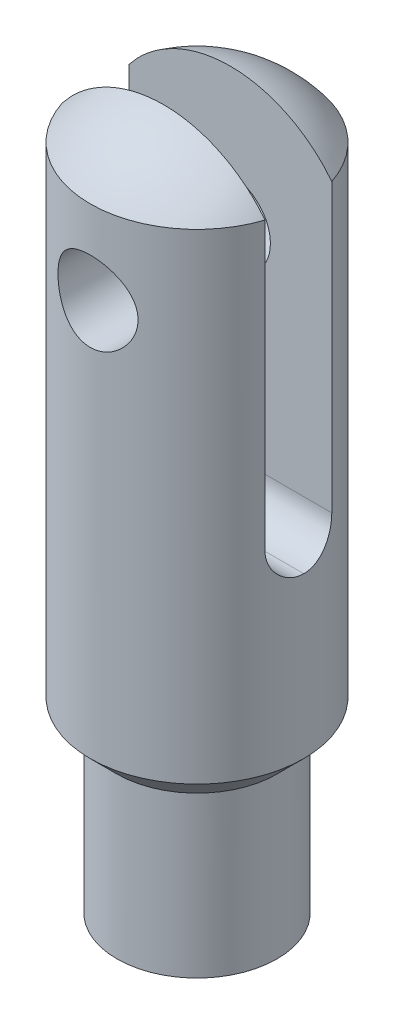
ISO-10303-21;
HEADER;
FILE_DESCRIPTION(('STEP AP214'),'2;1');
FILE_NAME('part.step','',(''),(''),'','','');
FILE_SCHEMA(('AUTOMOTIVE_DESIGN { 1 0 10303 214 1 1 1 1 }'));
ENDSEC;
DATA;
#1=APPLICATION_CONTEXT('core data for automotive mechanical design processes');
#2=APPLICATION_PROTOCOL_DEFINITION('international standard','automotive_design',2000,#1);
#3=PRODUCT_CONTEXT('',#1,'mechanical');
#4=PRODUCT('Part','Part','',(#3));
#5=PRODUCT_RELATED_PRODUCT_CATEGORY('part','',(#4));
#6=PRODUCT_DEFINITION_FORMATION('','',#4);
#7=PRODUCT_DEFINITION_CONTEXT('part definition',#1,'design');
#8=PRODUCT_DEFINITION('design','',#6,#7);
#9=PRODUCT_DEFINITION_SHAPE('','',#8);
#10=(LENGTH_UNIT() NAMED_UNIT(*) SI_UNIT(.MILLI.,.METRE.));
#11=(NAMED_UNIT(*) PLANE_ANGLE_UNIT() SI_UNIT($,.RADIAN.));
#12=(NAMED_UNIT(*) SI_UNIT($,.STERADIAN.) SOLID_ANGLE_UNIT());
#13=UNCERTAINTY_MEASURE_WITH_UNIT(LENGTH_MEASURE(1.E-05),#10,'distance_accuracy_value','');
#14=(GEOMETRIC_REPRESENTATION_CONTEXT(3) GLOBAL_UNCERTAINTY_ASSIGNED_CONTEXT((#13)) GLOBAL_UNIT_ASSIGNED_CONTEXT((#10,
#11,#12)) REPRESENTATION_CONTEXT('',''));
#15=CARTESIAN_POINT('',(0.,0.,0.));
#16=DIRECTION('',(0.,0.,1.));
#17=DIRECTION('',(1.,0.,0.));
#18=AXIS2_PLACEMENT_3D('',#15,#16,#17);
#19=CARTESIAN_POINT('',(4.,0.,0.));
#20=DIRECTION('',(0.,-1.,0.));
#21=DIRECTION('',(0.,0.,-1.));
#22=AXIS2_PLACEMENT_3D('',#19,#20,#21);
#23=CYLINDRICAL_SURFACE('',#22,4.);
#24=CARTESIAN_POINT('',(4.,0.,0.));
#25=DIRECTION('',(0.,-1.,0.));
#26=DIRECTION('',(0.,0.,-1.));
#27=AXIS2_PLACEMENT_3D('',#24,#25,#26);
#28=CIRCLE('',#27,4.);
#29=CARTESIAN_POINT('',(4.,0.,-4.));
#30=VERTEX_POINT('',#29);
#31=EDGE_CURVE('E121',#30,#30,#28,.T.);
#32=ORIENTED_EDGE('',*,*,#31,.F.);
#33=EDGE_LOOP('',(#32));
#34=FACE_BOUND('',#33,.T.);
#35=CARTESIAN_POINT('',(0.200328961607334,7.25,1.25));
#36=CARTESIAN_POINT('',(0.200332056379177,7.2157561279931,1.2500007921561));
#37=CARTESIAN_POINT('',(0.199865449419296,7.18152958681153,1.24859192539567));
#38=CARTESIAN_POINT('',(0.19802439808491,7.1133393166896,1.24297810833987));
#39=CARTESIAN_POINT('',(0.196650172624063,7.0793755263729,1.23877383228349));
#40=CARTESIAN_POINT('',(0.191226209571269,6.97844047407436,1.22204230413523));
#41=CARTESIAN_POINT('',(0.185874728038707,6.91217369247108,1.205395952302));
#42=CARTESIAN_POINT('',(0.172342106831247,6.78355649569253,1.16170143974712));
#43=CARTESIAN_POINT('',(0.164162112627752,6.72120450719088,1.13465748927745));
#44=CARTESIAN_POINT('',(0.145899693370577,6.60187177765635,1.07098313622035));
#45=CARTESIAN_POINT('',(0.135816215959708,6.54489403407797,1.03434742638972));
#46=CARTESIAN_POINT('',(0.11449905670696,6.43602191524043,0.951197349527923));
#47=CARTESIAN_POINT('',(0.103239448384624,6.38433923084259,0.904412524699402));
#48=CARTESIAN_POINT('',(0.0810581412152,6.28940663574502,0.802864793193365));
#49=CARTESIAN_POINT('',(0.0701365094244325,6.24615838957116,0.748100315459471));
#50=CARTESIAN_POINT('',(0.0495611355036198,6.16837616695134,0.630607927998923));
#51=CARTESIAN_POINT('',(0.0399422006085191,6.13406470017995,0.567726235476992));
#52=CARTESIAN_POINT('',(0.023369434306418,6.07660741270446,0.436752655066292));
#53=CARTESIAN_POINT('',(0.0164132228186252,6.0534516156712,0.368665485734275));
#54=CARTESIAN_POINT('',(0.00753372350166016,6.02426752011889,0.250216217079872));
#55=CARTESIAN_POINT('',(0.00472710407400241,6.01518682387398,0.200651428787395));
#56=CARTESIAN_POINT('',(0.000952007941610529,6.00304637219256,0.100734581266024));
#57=CARTESIAN_POINT('',(-1.69089153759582E-05,5.99998517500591,0.0503827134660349));
#58=CARTESIAN_POINT('',(0.,6.,0.));
#59=B_SPLINE_CURVE_WITH_KNOTS('',3,(#35,#36,#37,#38,#39,#40,#41,#42,#43,#44,#45,#46,#47,#48,#49,
#50,#51,#52,#53,#54,#55,#56,#57,#58),.UNSPECIFIED.,.F.,.F.,(4,2,2,2,2,2,2,2,2,2,2,4),(0.,
0.102665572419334,0.20530639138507,0.409842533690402,0.614295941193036,0.818862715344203,
1.02975563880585,1.24069013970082,1.45646042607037,1.67203739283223,1.82306277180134,
1.97405197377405),.UNSPECIFIED.);
#60=CARTESIAN_POINT('',(0.200328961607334,7.25,1.25));
#61=VERTEX_POINT('',#60);
#62=CARTESIAN_POINT('',(0.,6.,0.));
#63=VERTEX_POINT('',#62);
#64=EDGE_CURVE('E71',#61,#63,#59,.T.);
#65=ORIENTED_EDGE('',*,*,#64,.T.);
#66=CARTESIAN_POINT('',(0.,6.,0.));
#67=CARTESIAN_POINT('',(-2.39446069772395E-06,5.99999931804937,-0.0342852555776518));
#68=CARTESIAN_POINT('',(0.000441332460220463,6.00141148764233,-0.0685533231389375));
#69=CARTESIAN_POINT('',(0.00219547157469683,6.00703917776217,-0.136829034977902));
#70=CARTESIAN_POINT('',(0.00350570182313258,6.01125410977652,-0.170836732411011));
#71=CARTESIAN_POINT('',(0.00868618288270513,6.02803178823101,-0.271919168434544));
#72=CARTESIAN_POINT('',(0.013806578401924,6.04472778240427,-0.338292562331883));
#73=CARTESIAN_POINT('',(0.0268407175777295,6.08856660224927,-0.467129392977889));
#74=CARTESIAN_POINT('',(0.0347537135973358,6.11570663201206,-0.529593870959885));
#75=CARTESIAN_POINT('',(0.0525573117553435,6.17960591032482,-0.64911441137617));
#76=CARTESIAN_POINT('',(0.0624488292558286,6.21636961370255,-0.706167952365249));
#77=CARTESIAN_POINT('',(0.0834973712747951,6.29965404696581,-0.81496367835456));
#78=CARTESIAN_POINT('',(0.0946818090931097,6.34641628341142,-0.866515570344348));
#79=CARTESIAN_POINT('',(0.116898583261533,6.44786393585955,-0.961193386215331));
#80=CARTESIAN_POINT('',(0.127930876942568,6.50255152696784,-1.00431698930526));
#81=CARTESIAN_POINT('',(0.148892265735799,6.61996433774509,-1.08195731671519));
#82=CARTESIAN_POINT('',(0.158786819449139,6.682856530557,-1.11623148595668));
#83=CARTESIAN_POINT('',(0.175927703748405,6.81384816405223,-1.17361535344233));
#84=CARTESIAN_POINT('',(0.183176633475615,6.88194241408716,-1.196736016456));
#85=CARTESIAN_POINT('',(0.192442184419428,7.00029789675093,-1.22583238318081));
#86=CARTESIAN_POINT('',(0.195377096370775,7.04975409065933,-1.2348744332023));
#87=CARTESIAN_POINT('',(0.199330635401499,7.14946280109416,-1.24696551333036));
#88=CARTESIAN_POINT('',(0.200349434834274,7.19971524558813,-1.2500150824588));
#89=CARTESIAN_POINT('',(0.200328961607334,7.25,-1.25));
#90=B_SPLINE_CURVE_WITH_KNOTS('',3,(#66,#67,#68,#69,#70,#71,#72,#73,#74,#75,#76,#77,#78,#79,#80,
#81,#82,#83,#84,#85,#86,#87,#88,#89),.UNSPECIFIED.,.F.,.F.,(4,2,2,2,2,2,2,2,2,2,2,4),(0.,
0.102790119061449,0.205558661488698,0.410387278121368,0.615161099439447,0.82002987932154,
1.0305588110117,1.24114563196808,1.45700555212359,1.67265283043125,1.82335891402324,
1.97405144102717),.UNSPECIFIED.);
#91=CARTESIAN_POINT('',(0.200328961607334,7.25,-1.25));
#92=VERTEX_POINT('',#91);
#93=EDGE_CURVE('E167',#63,#92,#90,.T.);
#94=ORIENTED_EDGE('',*,*,#93,.T.);
#95=DIRECTION('',(0.,-1.,0.));
#96=VECTOR('',#95,1.);
#97=CARTESIAN_POINT('',(0.200328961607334,0.,-1.25));
#98=LINE('',#97,#96);
#99=CARTESIAN_POINT('',(0.200328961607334,18.,-1.25));
#100=VERTEX_POINT('',#99);
#101=EDGE_CURVE('E130',#100,#92,#98,.T.);
#102=ORIENTED_EDGE('',*,*,#101,.F.);
#103=CARTESIAN_POINT('',(4.,18.,0.));
#104=DIRECTION('',(0.,-1.,0.));
#105=DIRECTION('',(0.,0.,-1.));
#106=AXIS2_PLACEMENT_3D('',#103,#104,#105);
#107=CIRCLE('',#106,4.);
#108=CARTESIAN_POINT('',(7.79967103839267,18.,-1.25));
#109=VERTEX_POINT('',#108);
#110=EDGE_CURVE('E117',#100,#109,#107,.T.);
#111=ORIENTED_EDGE('',*,*,#110,.T.);
#112=DIRECTION('',(0.,-1.,0.));
#113=VECTOR('',#112,1.);
#114=CARTESIAN_POINT('',(7.79967103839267,0.,-1.25));
#115=LINE('',#114,#113);
#116=CARTESIAN_POINT('',(7.79967103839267,7.25,-1.25));
#117=VERTEX_POINT('',#116);
#118=EDGE_CURVE('E127',#117,#109,#115,.F.);
#119=ORIENTED_EDGE('',*,*,#118,.F.);
#120=CARTESIAN_POINT('',(7.79967103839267,7.25,-1.25));
#121=CARTESIAN_POINT('',(7.79966794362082,7.2157561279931,-1.2500007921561));
#122=CARTESIAN_POINT('',(7.8001345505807,7.18152958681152,-1.24859192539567));
#123=CARTESIAN_POINT('',(7.80197560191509,7.1133393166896,-1.24297810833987));
#124=CARTESIAN_POINT('',(7.80334982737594,7.0793755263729,-1.23877383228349));
#125=CARTESIAN_POINT('',(7.80877379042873,6.97844047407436,-1.22204230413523));
#126=CARTESIAN_POINT('',(7.81412527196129,6.91217369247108,-1.205395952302));
#127=CARTESIAN_POINT('',(7.82765789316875,6.78355649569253,-1.16170143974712));
#128=CARTESIAN_POINT('',(7.83583788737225,6.72120450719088,-1.13465748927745));
#129=CARTESIAN_POINT('',(7.85410030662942,6.60187177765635,-1.07098313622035));
#130=CARTESIAN_POINT('',(7.86418378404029,6.54489403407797,-1.03434742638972));
#131=CARTESIAN_POINT('',(7.88550094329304,6.43602191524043,-0.951197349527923));
#132=CARTESIAN_POINT('',(7.89676055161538,6.38433923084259,-0.904412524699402));
#133=CARTESIAN_POINT('',(7.9189418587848,6.28940663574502,-0.802864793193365));
#134=CARTESIAN_POINT('',(7.92986349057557,6.24615838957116,-0.748100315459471));
#135=CARTESIAN_POINT('',(7.95043886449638,6.16837616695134,-0.630607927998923));
#136=CARTESIAN_POINT('',(7.96005779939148,6.13406470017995,-0.567726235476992));
#137=CARTESIAN_POINT('',(7.97663056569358,6.07660741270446,-0.436752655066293));
#138=CARTESIAN_POINT('',(7.98358677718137,6.0534516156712,-0.368665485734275));
#139=CARTESIAN_POINT('',(7.99246627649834,6.02426752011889,-0.250216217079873));
#140=CARTESIAN_POINT('',(7.995272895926,6.01518682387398,-0.200651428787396));
#141=CARTESIAN_POINT('',(7.99904799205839,6.00304637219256,-0.100734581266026));
#142=CARTESIAN_POINT('',(8.00001690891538,5.99998517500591,-0.0503827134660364));
#143=CARTESIAN_POINT('',(8.,6.,0.));
#144=B_SPLINE_CURVE_WITH_KNOTS('',3,(#120,#121,#122,#123,#124,#125,#126,#127,#128,#129,#130,
#131,#132,#133,#134,#135,#136,#137,#138,#139,#140,#141,#142,#143),.UNSPECIFIED.,.F.,.F.,(4,2,2,
2,2,2,2,2,2,2,2,4),(0.,0.102665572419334,0.20530639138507,0.409842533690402,0.614295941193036,
0.818862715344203,1.02975563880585,1.24069013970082,1.45646042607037,1.67203739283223,
1.82306277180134,1.97405197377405),.UNSPECIFIED.);
#145=CARTESIAN_POINT('',(8.,6.,0.));
#146=VERTEX_POINT('',#145);
#147=EDGE_CURVE('E58',#117,#146,#144,.T.);
#148=ORIENTED_EDGE('',*,*,#147,.T.);
#149=CARTESIAN_POINT('',(8.,6.,0.));
#150=CARTESIAN_POINT('',(8.0000023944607,5.99999931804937,0.0342852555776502));
#151=CARTESIAN_POINT('',(7.99955866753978,6.00141148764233,0.0685533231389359));
#152=CARTESIAN_POINT('',(7.9978045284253,6.00703917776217,0.1368290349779));
#153=CARTESIAN_POINT('',(7.99649429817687,6.01125410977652,0.170836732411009));
#154=CARTESIAN_POINT('',(7.9913138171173,6.02803178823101,0.271919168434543));
#155=CARTESIAN_POINT('',(7.98619342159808,6.04472778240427,0.338292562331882));
#156=CARTESIAN_POINT('',(7.97315928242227,6.08856660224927,0.467129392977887));
#157=CARTESIAN_POINT('',(7.96524628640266,6.11570663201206,0.529593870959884));
#158=CARTESIAN_POINT('',(7.94744268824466,6.17960591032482,0.649114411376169));
#159=CARTESIAN_POINT('',(7.93755117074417,6.21636961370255,0.706167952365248));
#160=CARTESIAN_POINT('',(7.91650262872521,6.29965404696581,0.814963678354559));
#161=CARTESIAN_POINT('',(7.90531819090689,6.34641628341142,0.866515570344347));
#162=CARTESIAN_POINT('',(7.88310141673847,6.44786393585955,0.961193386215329));
#163=CARTESIAN_POINT('',(7.87206912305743,6.50255152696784,1.00431698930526));
#164=CARTESIAN_POINT('',(7.8511077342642,6.61996433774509,1.08195731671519));
#165=CARTESIAN_POINT('',(7.84121318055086,6.682856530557,1.11623148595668));
#166=CARTESIAN_POINT('',(7.8240722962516,6.81384816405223,1.17361535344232));
#167=CARTESIAN_POINT('',(7.81682336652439,6.88194241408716,1.196736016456));
#168=CARTESIAN_POINT('',(7.80755781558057,7.00029789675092,1.22583238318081));
#169=CARTESIAN_POINT('',(7.80462290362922,7.04975409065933,1.2348744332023));
#170=CARTESIAN_POINT('',(7.8006693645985,7.14946280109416,1.24696551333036));
#171=CARTESIAN_POINT('',(7.79965056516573,7.19971524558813,1.2500150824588));
#172=CARTESIAN_POINT('',(7.79967103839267,7.25,1.25));
#173=B_SPLINE_CURVE_WITH_KNOTS('',3,(#149,#150,#151,#152,#153,#154,#155,#156,#157,#158,#159,
#160,#161,#162,#163,#164,#165,#166,#167,#168,#169,#170,#171,#172),.UNSPECIFIED.,.F.,.F.,(4,2,2,
2,2,2,2,2,2,2,2,4),(0.,0.102790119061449,0.205558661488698,0.410387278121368,0.615161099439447,
0.82002987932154,1.0305588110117,1.24114563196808,1.45700555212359,1.67265283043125,
1.82335891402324,1.97405144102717),.UNSPECIFIED.);
#174=CARTESIAN_POINT('',(7.79967103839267,7.25,1.25));
#175=VERTEX_POINT('',#174);
#176=EDGE_CURVE('E147',#146,#175,#173,.T.);
#177=ORIENTED_EDGE('',*,*,#176,.T.);
#178=DIRECTION('',(0.,-1.,0.));
#179=VECTOR('',#178,1.);
#180=CARTESIAN_POINT('',(7.79967103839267,0.,1.25));
#181=LINE('',#180,#179);
#182=CARTESIAN_POINT('',(7.79967103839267,18.,1.25));
#183=VERTEX_POINT('',#182);
#184=EDGE_CURVE('E106',#175,#183,#181,.F.);
#185=ORIENTED_EDGE('',*,*,#184,.T.);
#186=CARTESIAN_POINT('',(0.200328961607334,18.,1.25));
#187=VERTEX_POINT('',#186);
#188=EDGE_CURVE('E107',#183,#187,#107,.T.);
#189=ORIENTED_EDGE('',*,*,#188,.T.);
#190=DIRECTION('',(0.,-1.,0.));
#191=VECTOR('',#190,1.);
#192=CARTESIAN_POINT('',(0.200328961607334,0.,1.25));
#193=LINE('',#192,#191);
#194=EDGE_CURVE('E96',#187,#61,#193,.T.);
#195=ORIENTED_EDGE('',*,*,#194,.T.);
#196=EDGE_LOOP('',(#65,#94,#102,#111,#119,#148,#177,#185,#189,#195));
#197=FACE_BOUND('',#196,.T.);
#198=CARTESIAN_POINT('',(2.5,14.8412291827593,3.70809924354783));
#199=CARTESIAN_POINT('',(2.49999695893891,14.7602216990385,3.70809640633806));
#200=CARTESIAN_POINT('',(2.50658402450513,14.6792342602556,3.71078260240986));
#201=CARTESIAN_POINT('',(2.53263812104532,14.5197010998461,3.72116159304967));
#202=CARTESIAN_POINT('',(2.55210476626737,14.4411553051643,3.72885423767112));
#203=CARTESIAN_POINT('',(2.60310342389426,14.2888538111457,3.748254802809));
#204=CARTESIAN_POINT('',(2.63460652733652,14.2150871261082,3.7599530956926));
#205=CARTESIAN_POINT('',(2.70868143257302,14.0738572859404,3.78603134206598));
#206=CARTESIAN_POINT('',(2.75125655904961,14.0063960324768,3.80041210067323));
#207=CARTESIAN_POINT('',(2.84853338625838,13.8763388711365,3.83103574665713));
#208=CARTESIAN_POINT('',(2.90369618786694,13.8141006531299,3.84733341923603));
#209=CARTESIAN_POINT('',(3.02360416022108,13.6995063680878,3.87949750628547));
#210=CARTESIAN_POINT('',(3.08835136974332,13.6471524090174,3.89536382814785));
#211=CARTESIAN_POINT('',(3.2283053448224,13.5520896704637,3.92552873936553));
#212=CARTESIAN_POINT('',(3.30379305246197,13.5097697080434,3.93975561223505));
#213=CARTESIAN_POINT('',(3.46144422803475,13.4385780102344,3.96438007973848));
#214=CARTESIAN_POINT('',(3.54360536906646,13.4097016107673,3.97477900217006));
#215=CARTESIAN_POINT('',(3.70851065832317,13.3674712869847,3.9901869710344));
#216=CARTESIAN_POINT('',(3.7910768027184,13.3535015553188,3.99540915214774));
#217=CARTESIAN_POINT('',(3.95753563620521,13.3395079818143,4.0006401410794));
#218=CARTESIAN_POINT('',(4.04142788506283,13.3394796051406,4.00065064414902));
#219=CARTESIAN_POINT('',(4.20374354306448,13.3530109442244,3.99559265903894));
#220=CARTESIAN_POINT('',(4.2822321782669,13.3658984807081,3.99077541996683));
#221=CARTESIAN_POINT('',(4.43583921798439,13.4037650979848,3.97693274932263));
#222=CARTESIAN_POINT('',(4.5109573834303,13.4287450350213,3.96790701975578));
#223=CARTESIAN_POINT('',(4.6569890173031,13.4903996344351,3.94637769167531));
#224=CARTESIAN_POINT('',(4.72782539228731,13.5272391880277,3.93382539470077));
#225=CARTESIAN_POINT('',(4.86248660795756,13.6114212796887,3.90651310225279));
#226=CARTESIAN_POINT('',(4.92630917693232,13.6587672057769,3.8917523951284));
#227=CARTESIAN_POINT('',(5.04909048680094,13.7658564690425,3.86052529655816));
#228=CARTESIAN_POINT('',(5.10754614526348,13.8261630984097,3.84400963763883));
#229=CARTESIAN_POINT('',(5.21370395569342,13.9558221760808,3.81182460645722));
#230=CARTESIAN_POINT('',(5.261403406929,14.0251768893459,3.79615544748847));
#231=CARTESIAN_POINT('',(5.34565611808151,14.1729486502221,3.76712703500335));
#232=CARTESIAN_POINT('',(5.38193847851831,14.2515326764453,3.75382677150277));
#233=CARTESIAN_POINT('',(5.44056464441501,14.4143254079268,3.73172438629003));
#234=CARTESIAN_POINT('',(5.46291620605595,14.498530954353,3.72291976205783));
#235=CARTESIAN_POINT('',(5.49190191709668,14.6652051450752,3.71139597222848));
#236=CARTESIAN_POINT('',(5.49933521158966,14.7475132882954,3.70836785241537));
#237=CARTESIAN_POINT('',(5.50057885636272,14.912238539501,3.70786539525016));
#238=CARTESIAN_POINT('',(5.49439261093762,14.9946556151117,3.71038967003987));
#239=CARTESIAN_POINT('',(5.46929733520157,15.153159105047,3.72039381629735));
#240=CARTESIAN_POINT('',(5.45100618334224,15.2293603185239,3.72763276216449));
#241=CARTESIAN_POINT('',(5.40299774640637,15.3775771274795,3.74596487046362));
#242=CARTESIAN_POINT('',(5.37327812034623,15.4495918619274,3.75705882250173));
#243=CARTESIAN_POINT('',(5.30200292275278,15.5903936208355,3.7823624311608));
#244=CARTESIAN_POINT('',(5.26004545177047,15.6589584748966,3.79667328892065));
#245=CARTESIAN_POINT('',(5.16591317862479,15.7883581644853,3.82662814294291));
#246=CARTESIAN_POINT('',(5.11373463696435,15.8491901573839,3.84227262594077));
#247=CARTESIAN_POINT('',(4.99672734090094,15.9653975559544,3.87433046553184));
#248=CARTESIAN_POINT('',(4.93130634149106,16.020182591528,3.89072969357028));
#249=CARTESIAN_POINT('',(4.79179747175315,16.1180675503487,3.92149874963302));
#250=CARTESIAN_POINT('',(4.71770957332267,16.1611674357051,3.93586857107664));
#251=CARTESIAN_POINT('',(4.56301632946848,16.2341752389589,3.96094985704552));
#252=CARTESIAN_POINT('',(4.48243443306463,16.2641283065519,3.9716738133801));
#253=CARTESIAN_POINT('',(4.31688188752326,16.3098855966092,3.98829436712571));
#254=CARTESIAN_POINT('',(4.23191332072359,16.3256964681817,3.99419323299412));
#255=CARTESIAN_POINT('',(4.06533558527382,16.3420035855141,4.00028407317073));
#256=CARTESIAN_POINT('',(3.98381923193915,16.3433386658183,4.00078860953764));
#257=CARTESIAN_POINT('',(3.82177321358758,16.3328140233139,3.99684889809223));
#258=CARTESIAN_POINT('',(3.74124343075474,16.3209558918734,3.9924052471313));
#259=CARTESIAN_POINT('',(3.58545175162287,16.2849703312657,3.97921089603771));
#260=CARTESIAN_POINT('',(3.51010926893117,16.2611492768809,3.97056791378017));
#261=CARTESIAN_POINT('',(3.36448452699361,16.2022191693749,3.9498778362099));
#262=CARTESIAN_POINT('',(3.29420322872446,16.1671079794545,3.93783009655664));
#263=CARTESIAN_POINT('',(3.15745982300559,16.0849152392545,3.91090618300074));
#264=CARTESIAN_POINT('',(3.09128245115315,16.0373925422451,3.89593240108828));
#265=CARTESIAN_POINT('',(2.96758265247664,15.9324213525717,3.86499507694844));
#266=CARTESIAN_POINT('',(2.9100633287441,15.8749693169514,3.84903118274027));
#267=CARTESIAN_POINT('',(2.80218785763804,15.7481650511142,3.81688129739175));
#268=CARTESIAN_POINT('',(2.75237000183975,15.678344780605,3.8007280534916));
#269=CARTESIAN_POINT('',(2.66515290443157,15.5308133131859,3.77098325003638));
#270=CARTESIAN_POINT('',(2.62775495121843,15.4531012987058,3.75739195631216));
#271=CARTESIAN_POINT('',(2.5653411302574,15.2882735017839,3.73402269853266));
#272=CARTESIAN_POINT('',(2.54093997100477,15.2008948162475,3.7244380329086));
#273=CARTESIAN_POINT('',(2.50827643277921,15.0227439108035,3.71147994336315));
#274=CARTESIAN_POINT('',(2.5000034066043,14.9319739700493,3.70810242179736));
#275=CARTESIAN_POINT('',(2.5,14.8412291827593,3.70809924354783));
#276=B_SPLINE_CURVE_WITH_KNOTS('',3,(#198,#199,#200,#201,#202,#203,#204,#205,#206,#207,#208,
#209,#210,#211,#212,#213,#214,#215,#216,#217,#218,#219,#220,#221,#222,#223,#224,#225,#226,#227,
#228,#229,#230,#231,#232,#233,#234,#235,#236,#237,#238,#239,#240,#241,#242,#243,#244,#245,#246,
#247,#248,#249,#250,#251,#252,#253,#254,#255,#256,#257,#258,#259,#260,#261,#262,#263,#264,#265,
#266,#267,#268,#269,#270,#271,#272,#273,#274,#275),.UNSPECIFIED.,.T.,.F.,(4,2,2,2,2,2,2,2,2,2,2,
2,2,2,2,2,2,2,2,2,2,2,2,2,2,2,2,2,2,2,2,2,2,2,2,2,2,2,4),(0.,0.242684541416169,
0.485361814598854,0.727459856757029,0.969630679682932,1.22274652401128,1.47591628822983,
1.73770072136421,1.9993942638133,2.24980018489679,2.50012465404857,2.73806472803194,
2.97602165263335,3.21744131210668,3.45893893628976,3.71456675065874,3.97025867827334,
4.23162592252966,4.49284751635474,4.73965657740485,4.98640395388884,5.22143845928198,
5.45652113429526,5.70041561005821,5.94439948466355,6.20385016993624,6.46330169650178,
6.72185508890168,6.98028685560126,7.22365720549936,7.46699820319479,7.7044027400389,
7.94185223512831,8.18928323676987,8.43680270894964,8.69738599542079,8.95799630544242,
9.23003178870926,9.50188762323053),.UNSPECIFIED.);
#277=CARTESIAN_POINT('',(2.5,14.8412291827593,3.70809924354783));
#278=VERTEX_POINT('',#277);
#279=EDGE_CURVE('E249',#278,#278,#276,.T.);
#280=ORIENTED_EDGE('',*,*,#279,.F.);
#281=EDGE_LOOP('',(#280));
#282=FACE_BOUND('',#281,.T.);
#283=CARTESIAN_POINT('',(4.,16.3412291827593,-4.));
#284=CARTESIAN_POINT('',(4.08123505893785,16.3412320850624,-4.00000217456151));
#285=CARTESIAN_POINT('',(4.16245024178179,16.3346094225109,-3.99750379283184));
#286=CARTESIAN_POINT('',(4.32245345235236,16.3084009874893,-3.98778696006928));
#287=CARTESIAN_POINT('',(4.40124182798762,16.2888170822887,-3.98056918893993));
#288=CARTESIAN_POINT('',(4.55406078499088,16.2374761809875,-3.96218832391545));
#289=CARTESIAN_POINT('',(4.62810022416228,16.2057426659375,-3.9510328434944));
#290=CARTESIAN_POINT('',(4.76979931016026,16.1311227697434,-3.92588767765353));
#291=CARTESIAN_POINT('',(4.83745723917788,16.0882333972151,-3.91189723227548));
#292=CARTESIAN_POINT('',(4.96734641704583,15.9906166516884,-3.88186246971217));
#293=CARTESIAN_POINT('',(5.02927073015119,15.9354989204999,-3.86576002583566));
#294=CARTESIAN_POINT('',(5.14324421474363,15.8158187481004,-3.83360220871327));
#295=CARTESIAN_POINT('',(5.19529036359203,15.7512534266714,-3.81754685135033));
#296=CARTESIAN_POINT('',(5.28998202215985,15.6115117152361,-3.78662470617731));
#297=CARTESIAN_POINT('',(5.3321939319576,15.5360248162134,-3.77182648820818));
#298=CARTESIAN_POINT('',(5.40318646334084,15.3783808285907,-3.74599860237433));
#299=CARTESIAN_POINT('',(5.43197244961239,15.2962264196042,-3.73496742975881));
#300=CARTESIAN_POINT('',(5.47408431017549,15.1311124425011,-3.71854412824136));
#301=CARTESIAN_POINT('',(5.48799593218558,15.0483241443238,-3.71293924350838));
#302=CARTESIAN_POINT('',(5.50179556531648,14.8814130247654,-3.70738061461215));
#303=CARTESIAN_POINT('',(5.5016893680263,14.7972907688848,-3.70742453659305));
#304=CARTESIAN_POINT('',(5.48790429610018,14.6354596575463,-3.71297511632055));
#305=CARTESIAN_POINT('',(5.47503808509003,14.5576682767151,-3.71815468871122));
#306=CARTESIAN_POINT('',(5.4374416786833,14.4054420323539,-3.7328493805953));
#307=CARTESIAN_POINT('',(5.41270969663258,14.3310076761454,-3.74236515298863));
#308=CARTESIAN_POINT('',(5.35163748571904,14.185952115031,-3.76485702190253));
#309=CARTESIAN_POINT('',(5.315086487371,14.115429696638,-3.77789517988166));
#310=CARTESIAN_POINT('',(5.23156073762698,13.9812834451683,-3.80594210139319));
#311=CARTESIAN_POINT('',(5.18458238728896,13.9176620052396,-3.82095154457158));
#312=CARTESIAN_POINT('',(5.07781780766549,13.7946255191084,-3.85248038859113));
#313=CARTESIAN_POINT('',(5.01738298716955,13.7357805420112,-3.86903347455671));
#314=CARTESIAN_POINT('',(4.88731259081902,13.6288912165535,-3.90091728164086));
#315=CARTESIAN_POINT('',(4.81767560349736,13.5808485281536,-3.91624781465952));
#316=CARTESIAN_POINT('',(4.66972343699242,13.4962987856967,-3.9442639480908));
#317=CARTESIAN_POINT('',(4.59129071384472,13.4599816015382,-3.95690498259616));
#318=CARTESIAN_POINT('',(4.42883685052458,13.4012465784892,-3.97778718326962));
#319=CARTESIAN_POINT('',(4.34481821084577,13.3788225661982,-3.98603030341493));
#320=CARTESIAN_POINT('',(4.17837524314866,13.3496063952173,-3.99684443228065));
#321=CARTESIAN_POINT('',(4.09610361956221,13.3420465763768,-3.99969369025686));
#322=CARTESIAN_POINT('',(3.93142752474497,13.3405381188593,-4.00025893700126));
#323=CARTESIAN_POINT('',(3.84902308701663,13.3465864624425,-3.99797606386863));
#324=CARTESIAN_POINT('',(3.68973795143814,13.3715392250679,-3.98871709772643));
#325=CARTESIAN_POINT('',(3.61276667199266,13.3899407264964,-3.98192470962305));
#326=CARTESIAN_POINT('',(3.46305824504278,13.4384152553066,-3.96451477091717));
#327=CARTESIAN_POINT('',(3.39032164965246,13.4684898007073,-3.9538967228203));
#328=CARTESIAN_POINT('',(3.24875223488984,13.5404155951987,-3.92949624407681));
#329=CARTESIAN_POINT('',(3.18009691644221,13.5825869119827,-3.91563000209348));
#330=CARTESIAN_POINT('',(3.05060728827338,13.6771472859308,-3.88626671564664));
#331=CARTESIAN_POINT('',(2.98977587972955,13.7295401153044,-3.87076907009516));
#332=CARTESIAN_POINT('',(2.87396920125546,13.8466333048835,-3.8387332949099));
#333=CARTESIAN_POINT('',(2.81953845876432,13.911871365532,-3.82218696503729));
#334=CARTESIAN_POINT('',(2.72228949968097,14.0508805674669,-3.79078815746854));
#335=CARTESIAN_POINT('',(2.67947232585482,14.1246524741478,-3.77593583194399));
#336=CARTESIAN_POINT('',(2.60662226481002,14.2792451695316,-3.74966829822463));
#337=CARTESIAN_POINT('',(2.57664314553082,14.3600939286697,-3.73826760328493));
#338=CARTESIAN_POINT('',(2.53092116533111,14.5262389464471,-3.72054032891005));
#339=CARTESIAN_POINT('',(2.51516949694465,14.6115324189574,-3.71421061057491));
#340=CARTESIAN_POINT('',(2.49913652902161,14.7782453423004,-3.70775894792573));
#341=CARTESIAN_POINT('',(2.49792668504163,14.8595618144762,-3.70726444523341));
#342=CARTESIAN_POINT('',(2.50863284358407,15.0211744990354,-3.71158412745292));
#343=CARTESIAN_POINT('',(2.52054760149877,15.1014708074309,-3.71639780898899));
#344=CARTESIAN_POINT('',(2.55644184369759,15.2562764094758,-3.73048141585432));
#345=CARTESIAN_POINT('',(2.58004201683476,15.3308875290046,-3.73961085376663));
#346=CARTESIAN_POINT('',(2.63830303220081,15.4751346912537,-3.76121548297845));
#347=CARTESIAN_POINT('',(2.67296667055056,15.5447694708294,-3.77369151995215));
#348=CARTESIAN_POINT('',(2.75447924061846,15.6810559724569,-3.80139723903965));
#349=CARTESIAN_POINT('',(2.8018716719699,15.7473599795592,-3.81673698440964));
#350=CARTESIAN_POINT('',(2.90665514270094,15.8713707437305,-3.84806246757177));
#351=CARTESIAN_POINT('',(2.96404935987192,15.929074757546,-3.86404840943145));
#352=CARTESIAN_POINT('',(3.09091960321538,16.0374311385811,-3.89590424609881));
#353=CARTESIAN_POINT('',(3.16088135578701,16.0875329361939,-3.91172104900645));
#354=CARTESIAN_POINT('',(3.30878677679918,16.1752518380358,-3.9405451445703));
#355=CARTESIAN_POINT('',(3.38673106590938,16.2128679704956,-3.95355221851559));
#356=CARTESIAN_POINT('',(3.55200091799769,16.2756060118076,-3.9757429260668));
#357=CARTESIAN_POINT('',(3.63958657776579,16.3001162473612,-3.98473657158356));
#358=CARTESIAN_POINT('',(3.81812426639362,16.33292214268,-3.99686242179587));
#359=CARTESIAN_POINT('',(3.90907458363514,16.3412259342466,-3.99999756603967));
#360=CARTESIAN_POINT('',(4.,16.3412291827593,-4.));
#361=B_SPLINE_CURVE_WITH_KNOTS('',3,(#283,#284,#285,#286,#287,#288,#289,#290,#291,#292,#293,
#294,#295,#296,#297,#298,#299,#300,#301,#302,#303,#304,#305,#306,#307,#308,#309,#310,#311,#312,
#313,#314,#315,#316,#317,#318,#319,#320,#321,#322,#323,#324,#325,#326,#327,#328,#329,#330,#331,
#332,#333,#334,#335,#336,#337,#338,#339,#340,#341,#342,#343,#344,#345,#346,#347,#348,#349,#350,
#351,#352,#353,#354,#355,#356,#357,#358,#359,#360),.UNSPECIFIED.,.T.,.F.,(4,2,2,2,2,2,2,2,2,2,2,
2,2,2,2,2,2,2,2,2,2,2,2,2,2,2,2,2,2,2,2,2,2,2,2,2,2,2,4),(0.,0.24336980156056,0.486704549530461,
0.729571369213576,0.972503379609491,1.22473618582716,1.47704604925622,1.73896674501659,
2.00078269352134,2.25185874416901,2.50283106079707,2.73878345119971,2.97477138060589,
3.21522408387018,3.45575990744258,3.71246153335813,3.96920257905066,4.22991375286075,
4.49050899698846,4.73725019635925,4.9839366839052,5.2211443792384,5.45838293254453,
5.70259221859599,5.94689180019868,6.20536519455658,6.46386178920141,6.72343066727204,
6.98283874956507,7.22558763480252,7.46831350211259,7.70363142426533,7.93900886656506,
8.18672471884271,8.43451941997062,8.69572329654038,8.95694749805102,9.22948515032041,
9.50188601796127),.UNSPECIFIED.);
#362=CARTESIAN_POINT('',(4.,16.3412291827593,-4.));
#363=VERTEX_POINT('',#362);
#364=EDGE_CURVE('E255',#363,#363,#361,.T.);
#365=ORIENTED_EDGE('',*,*,#364,.F.);
#366=EDGE_LOOP('',(#365));
#367=FACE_BOUND('',#366,.T.);
#368=ADVANCED_FACE('F47',(#34,#197,#282,#367),#23,.T.);
#369=CARTESIAN_POINT('',(4.,15.,0.));
#370=DIRECTION('',(0.,-1.,0.));
#371=DIRECTION('',(-1.,0.,0.));
#372=AXIS2_PLACEMENT_3D('',#369,#370,#371);
#373=SPHERICAL_SURFACE('',#372,5.);
#374=CARTESIAN_POINT('',(4.,15.,-1.25));
#375=DIRECTION('',(0.,0.,1.));
#376=DIRECTION('',(1.,0.,0.));
#377=AXIS2_PLACEMENT_3D('',#374,#375,#376);
#378=CIRCLE('',#377,4.84122918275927);
#379=EDGE_CURVE('E112',#109,#100,#378,.T.);
#380=ORIENTED_EDGE('',*,*,#379,.F.);
#381=ORIENTED_EDGE('',*,*,#110,.F.);
#382=EDGE_LOOP('',(#380,#381));
#383=FACE_BOUND('',#382,.T.);
#384=ADVANCED_FACE('F205',(#383),#373,.T.);
#385=ORIENTED_EDGE('',*,*,#188,.F.);
#386=CARTESIAN_POINT('',(4.,15.,1.25));
#387=DIRECTION('',(0.,0.,1.));
#388=DIRECTION('',(1.,0.,0.));
#389=AXIS2_PLACEMENT_3D('',#386,#387,#388);
#390=CIRCLE('',#389,4.84122918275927);
#391=EDGE_CURVE('E100',#183,#187,#390,.T.);
#392=ORIENTED_EDGE('',*,*,#391,.T.);
#393=EDGE_LOOP('',(#385,#392));
#394=FACE_BOUND('',#393,.T.);
#395=ADVANCED_FACE('F110',(#394),#373,.T.);
#396=CARTESIAN_POINT('',(20.,6.,-1.25));
#397=DIRECTION('',(0.,0.,1.));
#398=DIRECTION('',(1.,0.,0.));
#399=AXIS2_PLACEMENT_3D('',#396,#397,#398);
#400=PLANE('',#399);
#401=CARTESIAN_POINT('',(4.,14.8412291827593,-1.25));
#402=DIRECTION('',(0.,0.,1.));
#403=DIRECTION('',(1.,0.,0.));
#404=AXIS2_PLACEMENT_3D('',#401,#402,#403);
#405=CIRCLE('',#404,1.5);
#406=CARTESIAN_POINT('',(5.5,14.8412291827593,-1.25));
#407=VERTEX_POINT('',#406);
#408=EDGE_CURVE('E267',#407,#407,#405,.F.);
#409=ORIENTED_EDGE('',*,*,#408,.T.);
#410=EDGE_LOOP('',(#409));
#411=FACE_BOUND('',#410,.T.);
#412=ORIENTED_EDGE('',*,*,#101,.T.);
#413=DIRECTION('',(-1.,0.,0.));
#414=VECTOR('',#413,1.);
#415=CARTESIAN_POINT('',(7.79967103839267,7.25,-1.25));
#416=LINE('',#415,#414);
#417=EDGE_CURVE('E136',#92,#117,#416,.F.);
#418=ORIENTED_EDGE('',*,*,#417,.T.);
#419=ORIENTED_EDGE('',*,*,#118,.T.);
#420=ORIENTED_EDGE('',*,*,#379,.T.);
#421=EDGE_LOOP('',(#412,#418,#419,#420));
#422=FACE_BOUND('',#421,.T.);
#423=ADVANCED_FACE('F215',(#411,#422),#400,.T.);
#424=CARTESIAN_POINT('',(20.,6.,1.25));
#425=DIRECTION('',(0.,0.,1.));
#426=DIRECTION('',(1.,0.,0.));
#427=AXIS2_PLACEMENT_3D('',#424,#425,#426);
#428=PLANE('',#427);
#429=CARTESIAN_POINT('',(4.,14.8412291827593,1.25));
#430=DIRECTION('',(0.,0.,1.));
#431=DIRECTION('',(1.,0.,0.));
#432=AXIS2_PLACEMENT_3D('',#429,#430,#431);
#433=CIRCLE('',#432,1.5);
#434=CARTESIAN_POINT('',(5.5,14.8412291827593,1.25));
#435=VERTEX_POINT('',#434);
#436=EDGE_CURVE('E52',#435,#435,#433,.F.);
#437=ORIENTED_EDGE('',*,*,#436,.F.);
#438=EDGE_LOOP('',(#437));
#439=FACE_BOUND('',#438,.T.);
#440=ORIENTED_EDGE('',*,*,#184,.F.);
#441=DIRECTION('',(-1.,0.,0.));
#442=VECTOR('',#441,1.);
#443=CARTESIAN_POINT('',(20.,7.25,1.25));
#444=LINE('',#443,#442);
#445=EDGE_CURVE('E103',#175,#61,#444,.T.);
#446=ORIENTED_EDGE('',*,*,#445,.T.);
#447=ORIENTED_EDGE('',*,*,#194,.F.);
#448=ORIENTED_EDGE('',*,*,#391,.F.);
#449=EDGE_LOOP('',(#440,#446,#447,#448));
#450=FACE_BOUND('',#449,.T.);
#451=ADVANCED_FACE('F99',(#439,#450),#428,.F.);
#452=CARTESIAN_POINT('',(20.,7.25,0.));
#453=DIRECTION('',(1.,0.,0.));
#454=DIRECTION('',(0.,0.,-1.));
#455=AXIS2_PLACEMENT_3D('',#452,#453,#454);
#456=CYLINDRICAL_SURFACE('',#455,1.25);
#457=DIRECTION('',(-1.,0.,0.));
#458=VECTOR('',#457,1.);
#459=CARTESIAN_POINT('',(0.200328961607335,6.,0.));
#460=LINE('',#459,#458);
#461=EDGE_CURVE('E113',#146,#63,#460,.T.);
#462=ORIENTED_EDGE('',*,*,#461,.F.);
#463=ORIENTED_EDGE('',*,*,#147,.F.);
#464=ORIENTED_EDGE('',*,*,#417,.F.);
#465=ORIENTED_EDGE('',*,*,#93,.F.);
#466=EDGE_LOOP('',(#462,#463,#464,#465));
#467=FACE_BOUND('',#466,.T.);
#468=ADVANCED_FACE('F160',(#467),#456,.F.);
#469=CARTESIAN_POINT('',(20.,7.25,0.));
#470=DIRECTION('',(-1.,0.,0.));
#471=DIRECTION('',(0.,0.,1.));
#472=AXIS2_PLACEMENT_3D('',#469,#470,#471);
#473=CYLINDRICAL_SURFACE('',#472,1.25);
#474=ORIENTED_EDGE('',*,*,#176,.F.);
#475=ORIENTED_EDGE('',*,*,#461,.T.);
#476=ORIENTED_EDGE('',*,*,#64,.F.);
#477=ORIENTED_EDGE('',*,*,#445,.F.);
#478=EDGE_LOOP('',(#474,#475,#476,#477));
#479=FACE_BOUND('',#478,.T.);
#480=ADVANCED_FACE('F156',(#479),#473,.F.);
#481=CARTESIAN_POINT('',(4.,-7.,0.));
#482=DIRECTION('',(0.,1.,0.));
#483=DIRECTION('',(0.,0.,1.));
#484=AXIS2_PLACEMENT_3D('',#481,#482,#483);
#485=CYLINDRICAL_SURFACE('',#484,3.);
#486=CARTESIAN_POINT('',(4.,-1.,0.));
#487=DIRECTION('',(0.,1.,0.));
#488=DIRECTION('',(0.,0.,1.));
#489=AXIS2_PLACEMENT_3D('',#486,#487,#488);
#490=CIRCLE('',#489,3.);
#491=CARTESIAN_POINT('',(4.,-1.,3.));
#492=VERTEX_POINT('',#491);
#493=EDGE_CURVE('E11',#492,#492,#490,.F.);
#494=ORIENTED_EDGE('',*,*,#493,.T.);
#495=EDGE_LOOP('',(#494));
#496=FACE_BOUND('',#495,.T.);
#497=CARTESIAN_POINT('',(4.,-7.,0.));
#498=DIRECTION('',(0.,-1.,0.));
#499=DIRECTION('',(0.,0.,-1.));
#500=AXIS2_PLACEMENT_3D('',#497,#498,#499);
#501=CIRCLE('',#500,3.);
#502=CARTESIAN_POINT('',(4.,-7.,-3.));
#503=VERTEX_POINT('',#502);
#504=EDGE_CURVE('E181',#503,#503,#501,.T.);
#505=ORIENTED_EDGE('',*,*,#504,.F.);
#506=EDGE_LOOP('',(#505));
#507=FACE_BOUND('',#506,.T.);
#508=ADVANCED_FACE('F159',(#496,#507),#485,.T.);
#509=CARTESIAN_POINT('',(4.,-7.,0.));
#510=DIRECTION('',(0.,-1.,0.));
#511=DIRECTION('',(0.,0.,-1.));
#512=AXIS2_PLACEMENT_3D('',#509,#510,#511);
#513=PLANE('',#512);
#514=CARTESIAN_POINT('',(4.,-7.,0.));
#515=DIRECTION('',(0.,-1.,0.));
#516=DIRECTION('',(0.,0.,-1.));
#517=AXIS2_PLACEMENT_3D('',#514,#515,#516);
#518=CIRCLE('',#517,1.5);
#519=CARTESIAN_POINT('',(4.,-7.,-1.5));
#520=VERTEX_POINT('',#519);
#521=EDGE_CURVE('E191',#520,#520,#518,.T.);
#522=ORIENTED_EDGE('',*,*,#521,.F.);
#523=EDGE_LOOP('',(#522));
#524=FACE_BOUND('',#523,.T.);
#525=ORIENTED_EDGE('',*,*,#504,.T.);
#526=EDGE_LOOP('',(#525));
#527=FACE_BOUND('',#526,.T.);
#528=ADVANCED_FACE('F230',(#524,#527),#513,.T.);
#529=CARTESIAN_POINT('',(4.,-1.,0.));
#530=DIRECTION('',(0.,1.,0.));
#531=DIRECTION('',(0.,0.,1.));
#532=AXIS2_PLACEMENT_3D('',#529,#530,#531);
#533=CONICAL_SURFACE('',#532,3.,0.785398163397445);
#534=ORIENTED_EDGE('',*,*,#31,.T.);
#535=EDGE_LOOP('',(#534));
#536=FACE_BOUND('',#535,.T.);
#537=ORIENTED_EDGE('',*,*,#493,.F.);
#538=EDGE_LOOP('',(#537));
#539=FACE_BOUND('',#538,.T.);
#540=ADVANCED_FACE('F50',(#536,#539),#533,.T.);
#541=CARTESIAN_POINT('',(4.,5.,0.));
#542=DIRECTION('',(0.,-1.,0.));
#543=DIRECTION('',(0.,0.,-1.));
#544=AXIS2_PLACEMENT_3D('',#541,#542,#543);
#545=CYLINDRICAL_SURFACE('',#544,1.5);
#546=CARTESIAN_POINT('',(4.,5.,0.));
#547=DIRECTION('',(0.,-1.,0.));
#548=DIRECTION('',(0.,0.,-1.));
#549=AXIS2_PLACEMENT_3D('',#546,#547,#548);
#550=CIRCLE('',#549,1.5);
#551=CARTESIAN_POINT('',(4.,5.,-1.5));
#552=VERTEX_POINT('',#551);
#553=EDGE_CURVE('E185',#552,#552,#550,.T.);
#554=ORIENTED_EDGE('',*,*,#553,.F.);
#555=EDGE_LOOP('',(#554));
#556=FACE_BOUND('',#555,.T.);
#557=ORIENTED_EDGE('',*,*,#521,.T.);
#558=EDGE_LOOP('',(#557));
#559=FACE_BOUND('',#558,.T.);
#560=ADVANCED_FACE('F235',(#556,#559),#545,.F.);
#561=CARTESIAN_POINT('',(4.,5.,0.));
#562=DIRECTION('',(0.,-1.,0.));
#563=DIRECTION('',(0.,0.,-1.));
#564=AXIS2_PLACEMENT_3D('',#561,#562,#563);
#565=PLANE('',#564);
#566=ORIENTED_EDGE('',*,*,#553,.T.);
#567=EDGE_LOOP('',(#566));
#568=FACE_BOUND('',#567,.T.);
#569=ADVANCED_FACE('F238',(#568),#565,.T.);
#570=CARTESIAN_POINT('',(4.,14.8412291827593,12.));
#571=DIRECTION('',(0.,0.,-1.));
#572=DIRECTION('',(-1.,0.,0.));
#573=AXIS2_PLACEMENT_3D('',#570,#571,#572);
#574=CYLINDRICAL_SURFACE('',#573,1.5);
#575=ORIENTED_EDGE('',*,*,#436,.T.);
#576=EDGE_LOOP('',(#575));
#577=FACE_BOUND('',#576,.T.);
#578=ORIENTED_EDGE('',*,*,#279,.T.);
#579=EDGE_LOOP('',(#578));
#580=FACE_BOUND('',#579,.T.);
#581=ADVANCED_FACE('F241',(#577,#580),#574,.F.);
#582=ORIENTED_EDGE('',*,*,#408,.F.);
#583=EDGE_LOOP('',(#582));
#584=FACE_BOUND('',#583,.T.);
#585=ORIENTED_EDGE('',*,*,#364,.T.);
#586=EDGE_LOOP('',(#585));
#587=FACE_BOUND('',#586,.T.);
#588=ADVANCED_FACE('F243',(#584,#587),#574,.F.);
#589=CLOSED_SHELL('',(#368,#384,#395,#423,#451,#468,#480,#508,#528,#540,#560,#569,#581,#588));
#590=MANIFOLD_SOLID_BREP('B2',#589);
#591=ADVANCED_BREP_SHAPE_REPRESENTATION('',(#18,#590),#14);
#592=SHAPE_DEFINITION_REPRESENTATION(#9,#591);
ENDSEC;
END-ISO-10303-21;
